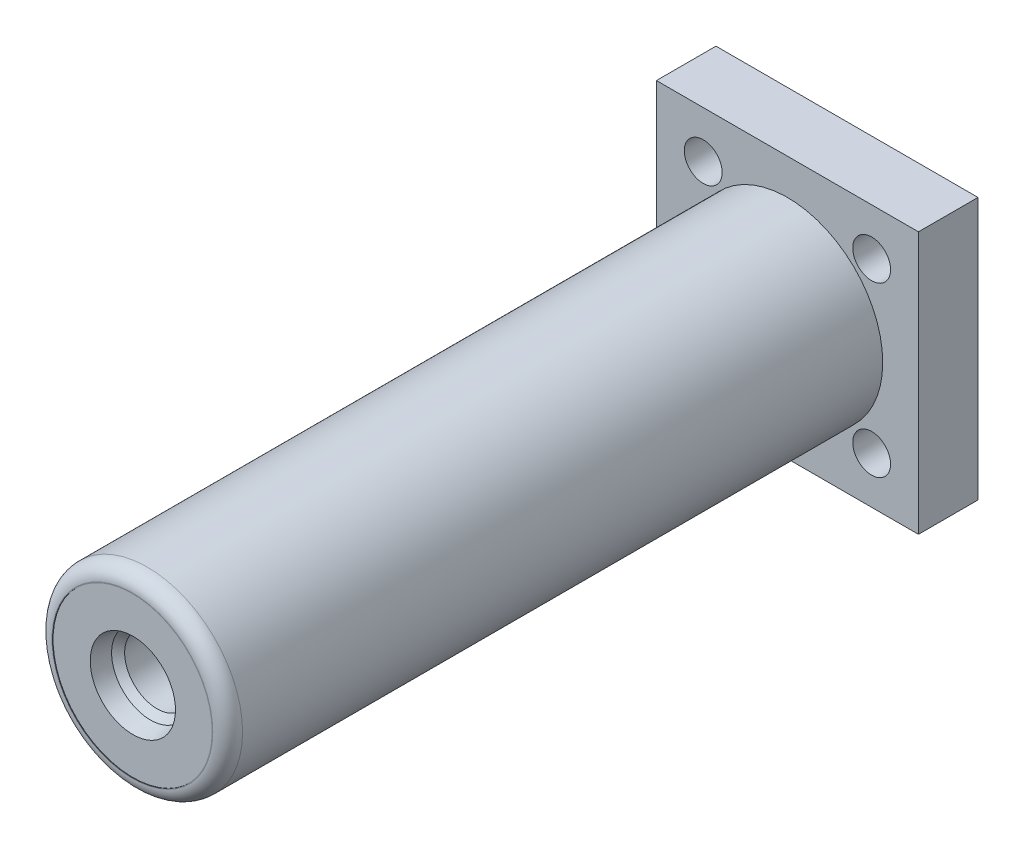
ISO-10303-21;
HEADER;
FILE_DESCRIPTION(('STEP AP214'),'2;1');
FILE_NAME('part.step','',(''),(''),'','','');
FILE_SCHEMA(('AUTOMOTIVE_DESIGN { 1 0 10303 214 1 1 1 1 }'));
ENDSEC;
DATA;
#1=APPLICATION_CONTEXT('core data for automotive mechanical design processes');
#2=APPLICATION_PROTOCOL_DEFINITION('international standard','automotive_design',2000,#1);
#3=PRODUCT_CONTEXT('',#1,'mechanical');
#4=PRODUCT('Part','Part','',(#3));
#5=PRODUCT_RELATED_PRODUCT_CATEGORY('part','',(#4));
#6=PRODUCT_DEFINITION_FORMATION('','',#4);
#7=PRODUCT_DEFINITION_CONTEXT('part definition',#1,'design');
#8=PRODUCT_DEFINITION('design','',#6,#7);
#9=PRODUCT_DEFINITION_SHAPE('','',#8);
#10=(LENGTH_UNIT() NAMED_UNIT(*) SI_UNIT(.MILLI.,.METRE.));
#11=(NAMED_UNIT(*) PLANE_ANGLE_UNIT() SI_UNIT($,.RADIAN.));
#12=(NAMED_UNIT(*) SI_UNIT($,.STERADIAN.) SOLID_ANGLE_UNIT());
#13=UNCERTAINTY_MEASURE_WITH_UNIT(LENGTH_MEASURE(1.E-05),#10,'distance_accuracy_value','');
#14=(GEOMETRIC_REPRESENTATION_CONTEXT(3) GLOBAL_UNCERTAINTY_ASSIGNED_CONTEXT((#13)) GLOBAL_UNIT_ASSIGNED_CONTEXT((#10,
#11,#12)) REPRESENTATION_CONTEXT('',''));
#15=CARTESIAN_POINT('',(0.,0.,0.));
#16=DIRECTION('',(0.,0.,1.));
#17=DIRECTION('',(1.,0.,0.));
#18=AXIS2_PLACEMENT_3D('',#15,#16,#17);
#19=CARTESIAN_POINT('',(0.,0.,50.7999999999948));
#20=DIRECTION('',(0.,0.,1.));
#21=DIRECTION('',(1.,0.,0.));
#22=AXIS2_PLACEMENT_3D('',#19,#20,#21);
#23=CYLINDRICAL_SURFACE('',#22,3.4544);
#24=CARTESIAN_POINT('',(0.,0.,73.5711));
#25=DIRECTION('',(0.,0.,1.));
#26=DIRECTION('',(1.,0.,0.));
#27=AXIS2_PLACEMENT_3D('',#24,#25,#26);
#28=CIRCLE('',#27,3.4544);
#29=CARTESIAN_POINT('',(3.4544,0.,73.5711));
#30=VERTEX_POINT('',#29);
#31=EDGE_CURVE('E160',#30,#30,#28,.T.);
#32=ORIENTED_EDGE('',*,*,#31,.T.);
#33=EDGE_LOOP('',(#32));
#34=FACE_BOUND('',#33,.T.);
#35=CARTESIAN_POINT('',(0.,0.,60.96));
#36=DIRECTION('',(0.,0.,-1.));
#37=DIRECTION('',(-1.,0.,0.));
#38=AXIS2_PLACEMENT_3D('',#35,#36,#37);
#39=CIRCLE('',#38,3.4544);
#40=CARTESIAN_POINT('',(-3.4544,0.,60.96));
#41=VERTEX_POINT('',#40);
#42=EDGE_CURVE('E157',#41,#41,#39,.T.);
#43=ORIENTED_EDGE('',*,*,#42,.T.);
#44=EDGE_LOOP('',(#43));
#45=FACE_BOUND('',#44,.T.);
#46=CARTESIAN_POINT('',(-3.4544,0.,69.69125));
#47=CARTESIAN_POINT('',(-3.4543990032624,-0.11878901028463,69.6912487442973));
#48=CARTESIAN_POINT('',(-3.4482195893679,-0.237583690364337,69.6823105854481));
#49=CARTESIAN_POINT('',(-3.42411041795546,-0.471357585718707,69.6471276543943));
#50=CARTESIAN_POINT('',(-3.40617494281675,-0.586334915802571,69.6208744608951));
#51=CARTESIAN_POINT('',(-3.36030887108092,-0.808732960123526,69.5527166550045));
#52=CARTESIAN_POINT('',(-3.33242679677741,-0.916187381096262,69.5108879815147));
#53=CARTESIAN_POINT('',(-3.26886612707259,-1.12205921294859,69.4134072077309));
#54=CARTESIAN_POINT('',(-3.23318648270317,-1.22047540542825,69.3577532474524));
#55=CARTESIAN_POINT('',(-3.15311607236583,-1.41519041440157,69.2289542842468));
#56=CARTESIAN_POINT('',(-3.10823678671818,-1.51055460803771,69.1547065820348));
#57=CARTESIAN_POINT('',(-3.01537225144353,-1.68834049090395,68.9935332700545));
#58=CARTESIAN_POINT('',(-2.96738246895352,-1.77074266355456,68.906588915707));
#59=CARTESIAN_POINT('',(-2.86373167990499,-1.93463831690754,68.7053970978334));
#60=CARTESIAN_POINT('',(-2.80815510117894,-2.01359044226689,68.589021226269));
#61=CARTESIAN_POINT('',(-2.70448941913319,-2.15081441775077,68.341636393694));
#62=CARTESIAN_POINT('',(-2.6563876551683,-2.20912145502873,68.2106528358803));
#63=CARTESIAN_POINT('',(-2.58845427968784,-2.28793091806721,67.9777486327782));
#64=CARTESIAN_POINT('',(-2.56447430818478,-2.31453836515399,67.8791178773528));
#65=CARTESIAN_POINT('',(-2.52739170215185,-2.35498172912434,67.6773587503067));
#66=CARTESIAN_POINT('',(-2.51426867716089,-2.36884159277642,67.5742391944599));
#67=CARTESIAN_POINT('',(-2.50095285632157,-2.3829023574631,67.3656605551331));
#68=CARTESIAN_POINT('',(-2.50082696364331,-2.38303258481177,67.2601921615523));
#69=CARTESIAN_POINT('',(-2.51370298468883,-2.36944117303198,67.0509398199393));
#70=CARTESIAN_POINT('',(-2.52671424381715,-2.35570967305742,66.9471571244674));
#71=CARTESIAN_POINT('',(-2.56261849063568,-2.31657191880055,66.7502244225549));
#72=CARTESIAN_POINT('',(-2.58488788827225,-2.29189677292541,66.6568077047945));
#73=CARTESIAN_POINT('',(-2.63656720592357,-2.23225222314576,66.475414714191));
#74=CARTESIAN_POINT('',(-2.66598273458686,-2.19727472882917,66.387442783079));
#75=CARTESIAN_POINT('',(-2.74552930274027,-2.09780365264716,66.1744056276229));
#76=CARTESIAN_POINT('',(-2.79859163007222,-2.02734305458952,66.0532056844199));
#77=CARTESIAN_POINT('',(-2.90788667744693,-1.8672201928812,65.8256661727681));
#78=CARTESIAN_POINT('',(-2.9641253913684,-1.77752066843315,65.7193561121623));
#79=CARTESIAN_POINT('',(-3.07443020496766,-1.57916895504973,65.5221763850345));
#80=CARTESIAN_POINT('',(-3.12846877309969,-1.47033526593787,65.4314727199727));
#81=CARTESIAN_POINT('',(-3.22828277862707,-1.23581096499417,65.2695759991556));
#82=CARTESIAN_POINT('',(-3.27407527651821,-1.11015611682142,65.1983424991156));
#83=CARTESIAN_POINT('',(-3.34372957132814,-0.874058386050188,65.0920687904));
#84=CARTESIAN_POINT('',(-3.37020272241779,-0.766420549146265,65.0525055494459));
#85=CARTESIAN_POINT('',(-3.41304858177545,-0.544693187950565,64.9890245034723));
#86=CARTESIAN_POINT('',(-3.42942814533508,-0.43060810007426,64.9650960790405));
#87=CARTESIAN_POINT('',(-3.4506556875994,-0.198648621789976,64.9341579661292));
#88=CARTESIAN_POINT('',(-3.45546120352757,-0.0807618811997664,64.9272105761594));
#89=CARTESIAN_POINT('',(-3.45294408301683,0.154611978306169,64.9308620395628));
#90=CARTESIAN_POINT('',(-3.44562134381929,0.272099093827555,64.9414610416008));
#91=CARTESIAN_POINT('',(-3.42033463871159,0.496151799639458,64.9784068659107));
#92=CARTESIAN_POINT('',(-3.40302011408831,0.602953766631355,65.0037934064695));
#93=CARTESIAN_POINT('',(-3.35966126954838,0.810431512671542,65.0682676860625));
#94=CARTESIAN_POINT('',(-3.33361533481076,0.911106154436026,65.1073579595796));
#95=CARTESIAN_POINT('',(-3.27234689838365,1.11197083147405,65.2011883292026));
#96=CARTESIAN_POINT('',(-3.23657607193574,1.21153845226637,65.2568945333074));
#97=CARTESIAN_POINT('',(-3.15950328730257,1.40029735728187,65.3806790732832));
#98=CARTESIAN_POINT('',(-3.11819745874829,1.48948129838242,65.4487660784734));
#99=CARTESIAN_POINT('',(-3.02541277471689,1.67087000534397,65.6083776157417));
#100=CARTESIAN_POINT('',(-2.97339606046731,1.7610263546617,65.7019186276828));
#101=CARTESIAN_POINT('',(-2.86983245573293,1.9251909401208,65.9025866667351));
#102=CARTESIAN_POINT('',(-2.81828586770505,1.99918939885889,66.0097218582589));
#103=CARTESIAN_POINT('',(-2.72692094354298,2.12176854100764,66.222944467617));
#104=CARTESIAN_POINT('',(-2.6864379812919,2.17233929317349,66.3275969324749));
#105=CARTESIAN_POINT('',(-2.61456388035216,2.25833747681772,66.5458321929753));
#106=CARTESIAN_POINT('',(-2.58315489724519,2.29379469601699,66.6593968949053));
#107=CARTESIAN_POINT('',(-2.53878654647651,2.3427202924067,66.8722037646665));
#108=CARTESIAN_POINT('',(-2.52351240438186,2.35901270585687,66.9703011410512));
#109=CARTESIAN_POINT('',(-2.50454292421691,2.37914907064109,67.1688358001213));
#110=CARTESIAN_POINT('',(-2.50083513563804,2.38300640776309,67.2692704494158));
#111=CARTESIAN_POINT('',(-2.50558341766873,2.37801141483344,67.4695384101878));
#112=CARTESIAN_POINT('',(-2.51404211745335,2.36915633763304,67.5693715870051));
#113=CARTESIAN_POINT('',(-2.54179191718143,2.33935293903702,67.7657135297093));
#114=CARTESIAN_POINT('',(-2.56109859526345,2.31838722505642,67.8622173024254));
#115=CARTESIAN_POINT('',(-2.61517031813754,2.25740389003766,68.078549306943));
#116=CARTESIAN_POINT('',(-2.65285060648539,2.21353180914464,68.1965482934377));
#117=CARTESIAN_POINT('',(-2.73638887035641,2.10938564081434,68.4218988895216));
#118=CARTESIAN_POINT('',(-2.78225930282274,2.04908649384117,68.5292338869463));
#119=CARTESIAN_POINT('',(-2.87817707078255,1.91209775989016,68.7347086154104));
#120=CARTESIAN_POINT('',(-2.92829406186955,1.83507699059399,68.8325943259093));
#121=CARTESIAN_POINT('',(-3.02744479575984,1.66645012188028,69.0155187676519));
#122=CARTESIAN_POINT('',(-3.07647818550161,1.57483934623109,69.1005533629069));
#123=CARTESIAN_POINT('',(-3.17677142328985,1.36261588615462,69.2681945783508));
#124=CARTESIAN_POINT('',(-3.22723128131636,1.23971100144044,69.3484551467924));
#125=CARTESIAN_POINT('',(-3.2937505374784,1.04349526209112,69.4517145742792));
#126=CARTESIAN_POINT('',(-3.31439363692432,0.976120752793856,69.483276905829));
#127=CARTESIAN_POINT('',(-3.3520169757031,0.837849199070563,69.5402352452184));
#128=CARTESIAN_POINT('',(-3.36899861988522,0.766953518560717,69.5656336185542));
#129=CARTESIAN_POINT('',(-3.40662633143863,0.583581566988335,69.6215390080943));
#130=CARTESIAN_POINT('',(-3.42440239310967,0.469080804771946,69.6475552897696));
#131=CARTESIAN_POINT('',(-3.44828509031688,0.236386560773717,69.6824045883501));
#132=CARTESIAN_POINT('',(-3.45440099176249,0.118196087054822,69.691251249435));
#133=CARTESIAN_POINT('',(-3.4544,0.,69.69125));
#134=B_SPLINE_CURVE_WITH_KNOTS('',3,(#46,#47,#48,#49,#50,#51,#52,#53,#54,#55,#56,#57,#58,#59,
#60,#61,#62,#63,#64,#65,#66,#67,#68,#69,#70,#71,#72,#73,#74,#75,#76,#77,#78,#79,#80,#81,#82,#83,
#84,#85,#86,#87,#88,#89,#90,#91,#92,#93,#94,#95,#96,#97,#98,#99,#100,#101,#102,#103,#104,#105,
#106,#107,#108,#109,#110,#111,#112,#113,#114,#115,#116,#117,#118,#119,#120,#121,#122,#123,#124,
#125,#126,#127,#128,#129,#130,#131,#132,#133),.UNSPECIFIED.,.T.,.F.,(4,2,2,2,2,2,2,2,2,2,2,2,2,
2,2,2,2,2,2,2,2,2,2,2,2,2,2,2,2,2,2,2,2,2,2,2,2,2,2,2,2,2,2,4),(0.,0.35590074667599,
0.711974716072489,1.06633489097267,1.42074276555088,1.80608526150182,2.19200251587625,
2.64359844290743,3.09442092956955,3.40801493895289,3.72101864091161,4.03563345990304,
4.35047224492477,4.64686587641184,4.94349288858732,5.39084207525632,5.83906561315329,
6.29179603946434,6.74357876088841,7.09518462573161,7.4465514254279,7.79920536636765,
8.15186229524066,8.48383146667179,8.81586206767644,9.17321282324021,9.53081477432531,
9.94900619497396,10.3674499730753,10.7353771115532,11.1025757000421,11.4030833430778,
11.7032673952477,12.0035163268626,12.304197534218,12.6962976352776,13.088999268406,
13.4903339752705,13.8917975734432,14.3544588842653,14.5857444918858,14.816941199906,
15.1713472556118,15.5254715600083),.UNSPECIFIED.);
#135=CARTESIAN_POINT('',(-3.4544,0.,69.69125));
#136=VERTEX_POINT('',#135);
#137=EDGE_CURVE('E151',#136,#136,#134,.T.);
#138=ORIENTED_EDGE('',*,*,#137,.F.);
#139=EDGE_LOOP('',(#138));
#140=FACE_BOUND('',#139,.T.);
#141=ADVANCED_FACE('F30',(#34,#45,#140),#23,.F.);
#142=CARTESIAN_POINT('',(13.97,-13.97,6.35));
#143=DIRECTION('',(0.,0.,1.));
#144=DIRECTION('',(1.,0.,0.));
#145=AXIS2_PLACEMENT_3D('',#142,#143,#144);
#146=PLANE('',#145);
#147=CARTESIAN_POINT('',(-8.98025612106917,8.98025612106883,6.35));
#148=DIRECTION('',(0.,0.,1.));
#149=DIRECTION('',(1.,0.,0.));
#150=AXIS2_PLACEMENT_3D('',#147,#148,#149);
#151=CIRCLE('',#150,2.01930000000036);
#152=CARTESIAN_POINT('',(-6.96095612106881,8.98025612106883,6.35));
#153=VERTEX_POINT('',#152);
#154=EDGE_CURVE('E128',#153,#153,#151,.T.);
#155=ORIENTED_EDGE('',*,*,#154,.F.);
#156=EDGE_LOOP('',(#155));
#157=FACE_BOUND('',#156,.T.);
#158=CARTESIAN_POINT('',(-8.98025612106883,-8.98025612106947,6.35));
#159=DIRECTION('',(0.,0.,1.));
#160=DIRECTION('',(1.,0.,0.));
#161=AXIS2_PLACEMENT_3D('',#158,#159,#160);
#162=CIRCLE('',#161,2.01930000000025);
#163=CARTESIAN_POINT('',(-6.96095612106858,-8.98025612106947,6.35));
#164=VERTEX_POINT('',#163);
#165=EDGE_CURVE('E237',#164,#164,#162,.T.);
#166=ORIENTED_EDGE('',*,*,#165,.F.);
#167=EDGE_LOOP('',(#166));
#168=FACE_BOUND('',#167,.T.);
#169=CARTESIAN_POINT('',(8.98025612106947,-8.98025612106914,6.35));
#170=DIRECTION('',(0.,0.,1.));
#171=DIRECTION('',(1.,0.,0.));
#172=AXIS2_PLACEMENT_3D('',#169,#170,#171);
#173=CIRCLE('',#172,2.01929999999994);
#174=CARTESIAN_POINT('',(10.9995561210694,-8.98025612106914,6.35));
#175=VERTEX_POINT('',#174);
#176=EDGE_CURVE('E243',#175,#175,#173,.T.);
#177=ORIENTED_EDGE('',*,*,#176,.F.);
#178=EDGE_LOOP('',(#177));
#179=FACE_BOUND('',#178,.T.);
#180=CARTESIAN_POINT('',(8.98025612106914,8.98025612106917,6.35));
#181=DIRECTION('',(0.,0.,1.));
#182=DIRECTION('',(1.,0.,0.));
#183=AXIS2_PLACEMENT_3D('',#180,#181,#182);
#184=CIRCLE('',#183,2.0193);
#185=CARTESIAN_POINT('',(10.9995561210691,8.98025612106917,6.35));
#186=VERTEX_POINT('',#185);
#187=EDGE_CURVE('E249',#186,#186,#184,.T.);
#188=ORIENTED_EDGE('',*,*,#187,.F.);
#189=EDGE_LOOP('',(#188));
#190=FACE_BOUND('',#189,.T.);
#191=DIRECTION('',(0.,1.,0.));
#192=VECTOR('',#191,1.);
#193=CARTESIAN_POINT('',(13.97,13.97,6.35));
#194=LINE('',#193,#192);
#195=CARTESIAN_POINT('',(13.97,-13.97,6.35));
#196=VERTEX_POINT('',#195);
#197=CARTESIAN_POINT('',(13.97,13.97,6.35));
#198=VERTEX_POINT('',#197);
#199=EDGE_CURVE('E103',#196,#198,#194,.T.);
#200=ORIENTED_EDGE('',*,*,#199,.T.);
#201=DIRECTION('',(-1.,0.,0.));
#202=VECTOR('',#201,1.);
#203=CARTESIAN_POINT('',(-13.97,13.97,6.35));
#204=LINE('',#203,#202);
#205=CARTESIAN_POINT('',(-13.97,13.97,6.35));
#206=VERTEX_POINT('',#205);
#207=EDGE_CURVE('E85',#198,#206,#204,.T.);
#208=ORIENTED_EDGE('',*,*,#207,.T.);
#209=DIRECTION('',(0.,-1.,0.));
#210=VECTOR('',#209,1.);
#211=CARTESIAN_POINT('',(-13.97,13.97,6.35));
#212=LINE('',#211,#210);
#213=CARTESIAN_POINT('',(-13.97,-13.97,6.35));
#214=VERTEX_POINT('',#213);
#215=EDGE_CURVE('E50',#206,#214,#212,.T.);
#216=ORIENTED_EDGE('',*,*,#215,.T.);
#217=DIRECTION('',(1.,0.,0.));
#218=VECTOR('',#217,1.);
#219=CARTESIAN_POINT('',(-13.97,-13.97,6.35));
#220=LINE('',#219,#218);
#221=EDGE_CURVE('E45',#214,#196,#220,.T.);
#222=ORIENTED_EDGE('',*,*,#221,.T.);
#223=EDGE_LOOP('',(#200,#208,#216,#222));
#224=FACE_BOUND('',#223,.T.);
#225=CARTESIAN_POINT('',(0.,0.,6.35));
#226=DIRECTION('',(0.,0.,1.));
#227=DIRECTION('',(1.,0.,0.));
#228=AXIS2_PLACEMENT_3D('',#225,#226,#227);
#229=CIRCLE('',#228,10.16);
#230=CARTESIAN_POINT('',(10.16,0.,6.35));
#231=VERTEX_POINT('',#230);
#232=EDGE_CURVE('E93',#231,#231,#229,.T.);
#233=ORIENTED_EDGE('',*,*,#232,.F.);
#234=EDGE_LOOP('',(#233));
#235=FACE_BOUND('',#234,.T.);
#236=ADVANCED_FACE('F164',(#157,#168,#179,#190,#224,#235),#146,.T.);
#237=CARTESIAN_POINT('',(13.97,13.97,6.35));
#238=DIRECTION('',(-1.,0.,0.));
#239=DIRECTION('',(0.,0.,1.));
#240=AXIS2_PLACEMENT_3D('',#237,#238,#239);
#241=PLANE('',#240);
#242=DIRECTION('',(0.,1.,0.));
#243=VECTOR('',#242,1.);
#244=CARTESIAN_POINT('',(13.97,13.97,0.));
#245=LINE('',#244,#243);
#246=CARTESIAN_POINT('',(13.97,-13.97,0.));
#247=VERTEX_POINT('',#246);
#248=CARTESIAN_POINT('',(13.97,13.97,0.));
#249=VERTEX_POINT('',#248);
#250=EDGE_CURVE('E76',#247,#249,#245,.T.);
#251=ORIENTED_EDGE('',*,*,#250,.T.);
#252=DIRECTION('',(0.,0.,-1.));
#253=VECTOR('',#252,1.);
#254=CARTESIAN_POINT('',(13.97,13.97,6.35));
#255=LINE('',#254,#253);
#256=EDGE_CURVE('E83',#198,#249,#255,.T.);
#257=ORIENTED_EDGE('',*,*,#256,.F.);
#258=ORIENTED_EDGE('',*,*,#199,.F.);
#259=DIRECTION('',(0.,0.,-1.));
#260=VECTOR('',#259,1.);
#261=CARTESIAN_POINT('',(13.97,-13.97,6.35));
#262=LINE('',#261,#260);
#263=EDGE_CURVE('E92',#196,#247,#262,.T.);
#264=ORIENTED_EDGE('',*,*,#263,.T.);
#265=EDGE_LOOP('',(#251,#257,#258,#264));
#266=FACE_BOUND('',#265,.T.);
#267=ADVANCED_FACE('F32',(#266),#241,.F.);
#268=CARTESIAN_POINT('',(-13.97,13.97,6.35));
#269=DIRECTION('',(0.,-1.,0.));
#270=DIRECTION('',(0.,0.,-1.));
#271=AXIS2_PLACEMENT_3D('',#268,#269,#270);
#272=PLANE('',#271);
#273=DIRECTION('',(-1.,0.,0.));
#274=VECTOR('',#273,1.);
#275=CARTESIAN_POINT('',(-13.97,13.97,0.));
#276=LINE('',#275,#274);
#277=CARTESIAN_POINT('',(-13.97,13.97,0.));
#278=VERTEX_POINT('',#277);
#279=EDGE_CURVE('E71',#249,#278,#276,.T.);
#280=ORIENTED_EDGE('',*,*,#279,.T.);
#281=DIRECTION('',(0.,0.,-1.));
#282=VECTOR('',#281,1.);
#283=CARTESIAN_POINT('',(-13.97,13.97,6.35));
#284=LINE('',#283,#282);
#285=EDGE_CURVE('E89',#206,#278,#284,.T.);
#286=ORIENTED_EDGE('',*,*,#285,.F.);
#287=ORIENTED_EDGE('',*,*,#207,.F.);
#288=ORIENTED_EDGE('',*,*,#256,.T.);
#289=EDGE_LOOP('',(#280,#286,#287,#288));
#290=FACE_BOUND('',#289,.T.);
#291=ADVANCED_FACE('F84',(#290),#272,.F.);
#292=CARTESIAN_POINT('',(-13.97,13.97,6.35));
#293=DIRECTION('',(1.,0.,0.));
#294=DIRECTION('',(0.,0.,-1.));
#295=AXIS2_PLACEMENT_3D('',#292,#293,#294);
#296=PLANE('',#295);
#297=DIRECTION('',(0.,-1.,0.));
#298=VECTOR('',#297,1.);
#299=CARTESIAN_POINT('',(-13.97,13.97,0.));
#300=LINE('',#299,#298);
#301=CARTESIAN_POINT('',(-13.97,-13.97,0.));
#302=VERTEX_POINT('',#301);
#303=EDGE_CURVE('E77',#278,#302,#300,.T.);
#304=ORIENTED_EDGE('',*,*,#303,.T.);
#305=DIRECTION('',(0.,0.,-1.));
#306=VECTOR('',#305,1.);
#307=CARTESIAN_POINT('',(-13.97,-13.97,6.35));
#308=LINE('',#307,#306);
#309=EDGE_CURVE('E109',#214,#302,#308,.T.);
#310=ORIENTED_EDGE('',*,*,#309,.F.);
#311=ORIENTED_EDGE('',*,*,#215,.F.);
#312=ORIENTED_EDGE('',*,*,#285,.T.);
#313=EDGE_LOOP('',(#304,#310,#311,#312));
#314=FACE_BOUND('',#313,.T.);
#315=ADVANCED_FACE('F317',(#314),#296,.F.);
#316=CARTESIAN_POINT('',(-13.97,-13.97,6.35));
#317=DIRECTION('',(0.,1.,0.));
#318=DIRECTION('',(0.,0.,1.));
#319=AXIS2_PLACEMENT_3D('',#316,#317,#318);
#320=PLANE('',#319);
#321=DIRECTION('',(1.,0.,0.));
#322=VECTOR('',#321,1.);
#323=CARTESIAN_POINT('',(-13.97,-13.97,0.));
#324=LINE('',#323,#322);
#325=EDGE_CURVE('E101',#302,#247,#324,.T.);
#326=ORIENTED_EDGE('',*,*,#325,.T.);
#327=ORIENTED_EDGE('',*,*,#263,.F.);
#328=ORIENTED_EDGE('',*,*,#221,.F.);
#329=ORIENTED_EDGE('',*,*,#309,.T.);
#330=EDGE_LOOP('',(#326,#327,#328,#329));
#331=FACE_BOUND('',#330,.T.);
#332=ADVANCED_FACE('F314',(#331),#320,.F.);
#333=CARTESIAN_POINT('',(13.97,-13.97,0.));
#334=DIRECTION('',(0.,0.,1.));
#335=DIRECTION('',(1.,0.,0.));
#336=AXIS2_PLACEMENT_3D('',#333,#334,#335);
#337=PLANE('',#336);
#338=CARTESIAN_POINT('',(0.,0.,0.));
#339=DIRECTION('',(0.,0.,1.));
#340=DIRECTION('',(1.,0.,0.));
#341=AXIS2_PLACEMENT_3D('',#338,#339,#340);
#342=CIRCLE('',#341,7.40963637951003);
#343=CARTESIAN_POINT('',(7.40963637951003,0.,0.));
#344=VERTEX_POINT('',#343);
#345=EDGE_CURVE('E11',#344,#344,#342,.T.);
#346=ORIENTED_EDGE('',*,*,#345,.T.);
#347=EDGE_LOOP('',(#346));
#348=FACE_BOUND('',#347,.T.);
#349=CARTESIAN_POINT('',(-8.98025612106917,8.98025612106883,0.));
#350=DIRECTION('',(0.,0.,1.));
#351=DIRECTION('',(1.,0.,0.));
#352=AXIS2_PLACEMENT_3D('',#349,#350,#351);
#353=CIRCLE('',#352,2.01930000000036);
#354=CARTESIAN_POINT('',(-6.96095612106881,8.98025612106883,0.));
#355=VERTEX_POINT('',#354);
#356=EDGE_CURVE('E234',#355,#355,#353,.T.);
#357=ORIENTED_EDGE('',*,*,#356,.T.);
#358=EDGE_LOOP('',(#357));
#359=FACE_BOUND('',#358,.T.);
#360=CARTESIAN_POINT('',(-8.98025612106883,-8.98025612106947,0.));
#361=DIRECTION('',(0.,0.,1.));
#362=DIRECTION('',(1.,0.,0.));
#363=AXIS2_PLACEMENT_3D('',#360,#361,#362);
#364=CIRCLE('',#363,2.01930000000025);
#365=CARTESIAN_POINT('',(-6.96095612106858,-8.98025612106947,0.));
#366=VERTEX_POINT('',#365);
#367=EDGE_CURVE('E240',#366,#366,#364,.T.);
#368=ORIENTED_EDGE('',*,*,#367,.T.);
#369=EDGE_LOOP('',(#368));
#370=FACE_BOUND('',#369,.T.);
#371=CARTESIAN_POINT('',(8.98025612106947,-8.98025612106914,0.));
#372=DIRECTION('',(0.,0.,1.));
#373=DIRECTION('',(1.,0.,0.));
#374=AXIS2_PLACEMENT_3D('',#371,#372,#373);
#375=CIRCLE('',#374,2.01929999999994);
#376=CARTESIAN_POINT('',(10.9995561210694,-8.98025612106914,0.));
#377=VERTEX_POINT('',#376);
#378=EDGE_CURVE('E246',#377,#377,#375,.T.);
#379=ORIENTED_EDGE('',*,*,#378,.T.);
#380=EDGE_LOOP('',(#379));
#381=FACE_BOUND('',#380,.T.);
#382=CARTESIAN_POINT('',(8.98025612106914,8.98025612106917,0.));
#383=DIRECTION('',(0.,0.,1.));
#384=DIRECTION('',(1.,0.,0.));
#385=AXIS2_PLACEMENT_3D('',#382,#383,#384);
#386=CIRCLE('',#385,2.0193);
#387=CARTESIAN_POINT('',(10.9995561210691,8.98025612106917,0.));
#388=VERTEX_POINT('',#387);
#389=EDGE_CURVE('E252',#388,#388,#386,.T.);
#390=ORIENTED_EDGE('',*,*,#389,.T.);
#391=EDGE_LOOP('',(#390));
#392=FACE_BOUND('',#391,.T.);
#393=ORIENTED_EDGE('',*,*,#250,.F.);
#394=ORIENTED_EDGE('',*,*,#325,.F.);
#395=ORIENTED_EDGE('',*,*,#303,.F.);
#396=ORIENTED_EDGE('',*,*,#279,.F.);
#397=EDGE_LOOP('',(#393,#394,#395,#396));
#398=FACE_BOUND('',#397,.T.);
#399=ADVANCED_FACE('F73',(#348,#359,#370,#381,#392,#398),#337,.F.);
#400=CARTESIAN_POINT('',(0.,0.,76.2));
#401=DIRECTION('',(0.,0.,-1.));
#402=DIRECTION('',(-1.,0.,0.));
#403=AXIS2_PLACEMENT_3D('',#400,#401,#402);
#404=CYLINDRICAL_SURFACE('',#403,10.16);
#405=CARTESIAN_POINT('',(0.,0.,74.6125));
#406=DIRECTION('',(0.,0.,1.));
#407=DIRECTION('',(1.,0.,0.));
#408=AXIS2_PLACEMENT_3D('',#405,#406,#407);
#409=CIRCLE('',#408,10.16);
#410=CARTESIAN_POINT('',(10.16,0.,74.6125));
#411=VERTEX_POINT('',#410);
#412=EDGE_CURVE('E159',#411,#411,#409,.F.);
#413=ORIENTED_EDGE('',*,*,#412,.T.);
#414=EDGE_LOOP('',(#413));
#415=FACE_BOUND('',#414,.T.);
#416=CARTESIAN_POINT('',(-10.16,0.,70.485));
#417=CARTESIAN_POINT('',(-10.1599991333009,-0.173835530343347,70.4849988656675));
#418=CARTESIAN_POINT('',(-10.155496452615,-0.347682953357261,70.4706763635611));
#419=CARTESIAN_POINT('',(-10.1379755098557,-0.690293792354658,70.4139149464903));
#420=CARTESIAN_POINT('',(-10.1249553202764,-0.859056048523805,70.3714696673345));
#421=CARTESIAN_POINT('',(-10.0918217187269,-1.18650650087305,70.2600337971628));
#422=CARTESIAN_POINT('',(-10.0717192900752,-1.34520984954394,70.1910842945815));
#423=CARTESIAN_POINT('',(-10.0264968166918,-1.64880239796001,70.028772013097));
#424=CARTESIAN_POINT('',(-10.0013759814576,-1.79368941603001,69.9354053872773));
#425=CARTESIAN_POINT('',(-9.94791542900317,-2.07001195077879,69.7238737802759));
#426=CARTESIAN_POINT('',(-9.91950558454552,-2.20096087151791,69.6050909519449));
#427=CARTESIAN_POINT('',(-9.8630751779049,-2.44144135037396,69.3474142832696));
#428=CARTESIAN_POINT('',(-9.83505468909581,-2.55096892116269,69.2085167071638));
#429=CARTESIAN_POINT('',(-9.78182307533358,-2.74813614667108,68.9103408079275));
#430=CARTESIAN_POINT('',(-9.75669850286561,-2.83516791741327,68.7506436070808));
#431=CARTESIAN_POINT('',(-9.71315816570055,-2.98093742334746,68.417967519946));
#432=CARTESIAN_POINT('',(-9.69474063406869,-3.03968261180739,68.2449921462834));
#433=CARTESIAN_POINT('',(-9.66743321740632,-3.12543088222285,67.8961606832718));
#434=CARTESIAN_POINT('',(-9.65827311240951,-3.15333659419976,67.7205482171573));
#435=CARTESIAN_POINT('',(-9.64971540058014,-3.1794336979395,67.3669134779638));
#436=CARTESIAN_POINT('',(-9.65031519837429,-3.1776329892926,67.188891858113));
#437=CARTESIAN_POINT('',(-9.66097100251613,-3.14507434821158,66.8429588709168));
#438=CARTESIAN_POINT('',(-9.6706522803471,-3.11546386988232,66.6749260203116));
#439=CARTESIAN_POINT('',(-9.69777145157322,-3.0299866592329,66.3463439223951));
#440=CARTESIAN_POINT('',(-9.71521016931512,-2.97411713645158,66.1857954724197));
#441=CARTESIAN_POINT('',(-9.75616651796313,-2.83689741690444,65.8740060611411));
#442=CARTESIAN_POINT('',(-9.77976923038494,-2.75518691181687,65.7229353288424));
#443=CARTESIAN_POINT('',(-9.83035515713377,-2.56885492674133,65.436273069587));
#444=CARTESIAN_POINT('',(-9.8573392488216,-2.46422749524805,65.3006855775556));
#445=CARTESIAN_POINT('',(-9.91315080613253,-2.22940106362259,65.0423516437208));
#446=CARTESIAN_POINT('',(-9.94200626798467,-2.09825480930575,64.9204707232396));
#447=CARTESIAN_POINT('',(-9.99722589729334,-1.81702559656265,64.7002213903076));
#448=CARTESIAN_POINT('',(-10.0235898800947,-1.66694123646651,64.6018547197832));
#449=CARTESIAN_POINT('',(-10.0711328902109,-1.35042811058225,64.4308396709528));
#450=CARTESIAN_POINT('',(-10.0922699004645,-1.18388106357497,64.3583977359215));
#451=CARTESIAN_POINT('',(-10.1266740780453,-0.840150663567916,64.242815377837));
#452=CARTESIAN_POINT('',(-10.1399436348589,-0.662970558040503,64.1996660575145));
#453=CARTESIAN_POINT('',(-10.1567332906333,-0.310350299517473,64.1453681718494));
#454=CARTESIAN_POINT('',(-10.1606101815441,-0.135107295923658,64.1330478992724));
#455=CARTESIAN_POINT('',(-10.159232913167,0.214960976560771,64.1374542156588));
#456=CARTESIAN_POINT('',(-10.1539800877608,0.389786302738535,64.1541765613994));
#457=CARTESIAN_POINT('',(-10.1351680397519,0.729537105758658,64.2152528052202));
#458=CARTESIAN_POINT('',(-10.1218185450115,0.89460064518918,64.2589094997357));
#459=CARTESIAN_POINT('',(-10.088375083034,1.2150138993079,64.3717644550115));
#460=CARTESIAN_POINT('',(-10.0682802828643,1.37036241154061,64.4409658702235));
#461=CARTESIAN_POINT('',(-10.0228029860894,1.67114831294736,64.6048319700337));
#462=CARTESIAN_POINT('',(-9.99730352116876,1.81625173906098,64.7000763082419));
#463=CARTESIAN_POINT('',(-9.94393261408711,2.08880926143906,64.9126291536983));
#464=CARTESIAN_POINT('',(-9.91606052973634,2.21625855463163,65.0299436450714));
#465=CARTESIAN_POINT('',(-9.85969567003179,2.45513215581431,65.2888175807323));
#466=CARTESIAN_POINT('',(-9.83122206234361,2.56572136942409,65.4311535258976));
#467=CARTESIAN_POINT('',(-9.77803345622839,2.76151975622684,65.732981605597));
#468=CARTESIAN_POINT('',(-9.75331839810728,2.84672933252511,65.8924734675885));
#469=CARTESIAN_POINT('',(-9.71071927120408,2.98882012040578,66.223756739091));
#470=CARTESIAN_POINT('',(-9.69280881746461,3.04581101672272,66.3954975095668));
#471=CARTESIAN_POINT('',(-9.66599973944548,3.12986151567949,66.7468121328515));
#472=CARTESIAN_POINT('',(-9.65709768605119,3.15693250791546,66.9263829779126));
#473=CARTESIAN_POINT('',(-9.64967063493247,3.17955691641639,67.2795303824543));
#474=CARTESIAN_POINT('',(-9.6506945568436,3.17648030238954,67.4530107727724));
#475=CARTESIAN_POINT('',(-9.66190829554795,3.14220398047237,67.7968534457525));
#476=CARTESIAN_POINT('',(-9.67209768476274,3.1110055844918,67.9672158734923));
#477=CARTESIAN_POINT('',(-9.7001790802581,3.02228833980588,68.2975368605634));
#478=CARTESIAN_POINT('',(-9.71795613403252,2.96516151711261,68.4576112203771));
#479=CARTESIAN_POINT('',(-9.75918048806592,2.82651777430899,68.7660306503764));
#480=CARTESIAN_POINT('',(-9.78262894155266,2.74499589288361,68.9143733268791));
#481=CARTESIAN_POINT('',(-9.83369857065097,2.55614614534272,69.2014007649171));
#482=CARTESIAN_POINT('',(-9.8614471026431,2.44793347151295,69.3394806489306));
#483=CARTESIAN_POINT('',(-9.91740457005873,2.21033085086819,69.5959652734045));
#484=CARTESIAN_POINT('',(-9.94561362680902,2.08093523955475,69.7143647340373));
#485=CARTESIAN_POINT('',(-10.0004187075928,1.7995561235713,69.9319976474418));
#486=CARTESIAN_POINT('',(-10.0269319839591,1.64697301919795,70.0304790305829));
#487=CARTESIAN_POINT('',(-10.0743199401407,1.32658901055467,70.2002632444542));
#488=CARTESIAN_POINT('',(-10.0951968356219,1.15879412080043,70.2715767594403));
#489=CARTESIAN_POINT('',(-10.1275045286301,0.827398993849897,70.3798220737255));
#490=CARTESIAN_POINT('',(-10.139584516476,0.664642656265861,70.4191501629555));
#491=CARTESIAN_POINT('',(-10.1558318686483,0.334593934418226,70.471737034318));
#492=CARTESIAN_POINT('',(-10.1600008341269,0.167302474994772,70.4850010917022));
#493=CARTESIAN_POINT('',(-10.16,0.,70.485));
#494=B_SPLINE_CURVE_WITH_KNOTS('',3,(#416,#417,#418,#419,#420,#421,#422,#423,#424,#425,#426,
#427,#428,#429,#430,#431,#432,#433,#434,#435,#436,#437,#438,#439,#440,#441,#442,#443,#444,#445,
#446,#447,#448,#449,#450,#451,#452,#453,#454,#455,#456,#457,#458,#459,#460,#461,#462,#463,#464,
#465,#466,#467,#468,#469,#470,#471,#472,#473,#474,#475,#476,#477,#478,#479,#480,#481,#482,#483,
#484,#485,#486,#487,#488,#489,#490,#491,#492,#493),.UNSPECIFIED.,.T.,.F.,(4,2,2,2,2,2,2,2,2,2,2,
2,2,2,2,2,2,2,2,2,2,2,2,2,2,2,2,2,2,2,2,2,2,2,2,2,2,2,4),(0.,0.520891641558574,1.04190120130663,
1.56210629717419,2.08239340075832,2.61716068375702,3.15202741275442,3.70011378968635,
4.24805567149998,4.77949641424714,5.31079583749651,5.8210937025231,6.33144580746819,
6.84925332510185,7.36719547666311,7.90871538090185,8.45027538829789,8.99605670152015,
9.54167216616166,10.0662122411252,10.5906756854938,11.1021019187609,11.6135913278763,
12.1375506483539,12.6616522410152,13.2065211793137,13.7513814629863,14.2941069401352,
14.8366257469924,15.3546099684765,15.8725700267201,16.3829470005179,16.8934278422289,
17.4238796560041,17.9544735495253,18.5023929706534,19.0500966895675,19.5515137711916,
20.0528293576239),.UNSPECIFIED.);
#495=CARTESIAN_POINT('',(-10.16,0.,70.485));
#496=VERTEX_POINT('',#495);
#497=EDGE_CURVE('E120',#496,#496,#494,.T.);
#498=ORIENTED_EDGE('',*,*,#497,.T.);
#499=EDGE_LOOP('',(#498));
#500=FACE_BOUND('',#499,.T.);
#501=ORIENTED_EDGE('',*,*,#232,.T.);
#502=EDGE_LOOP('',(#501));
#503=FACE_BOUND('',#502,.T.);
#504=ADVANCED_FACE('F130',(#415,#500,#503),#404,.T.);
#505=CARTESIAN_POINT('',(0.,0.,76.2));
#506=DIRECTION('',(0.,0.,1.));
#507=DIRECTION('',(1.,0.,0.));
#508=AXIS2_PLACEMENT_3D('',#505,#506,#507);
#509=PLANE('',#508);
#510=CARTESIAN_POINT('',(0.,0.,76.2));
#511=DIRECTION('',(0.,0.,1.));
#512=DIRECTION('',(1.,0.,0.));
#513=AXIS2_PLACEMENT_3D('',#510,#511,#512);
#514=CIRCLE('',#513,8.509);
#515=CARTESIAN_POINT('',(8.509,0.,76.2));
#516=VERTEX_POINT('',#515);
#517=EDGE_CURVE('E218',#516,#516,#514,.T.);
#518=ORIENTED_EDGE('',*,*,#517,.F.);
#519=EDGE_LOOP('',(#518));
#520=FACE_BOUND('',#519,.T.);
#521=CARTESIAN_POINT('',(0.,0.,76.2));
#522=DIRECTION('',(0.,0.,1.));
#523=DIRECTION('',(1.,0.,0.));
#524=AXIS2_PLACEMENT_3D('',#521,#522,#523);
#525=CIRCLE('',#524,8.5725);
#526=CARTESIAN_POINT('',(8.5725,0.,76.2));
#527=VERTEX_POINT('',#526);
#528=EDGE_CURVE('E88',#527,#527,#525,.T.);
#529=ORIENTED_EDGE('',*,*,#528,.T.);
#530=EDGE_LOOP('',(#529));
#531=FACE_BOUND('',#530,.T.);
#532=ADVANCED_FACE('F270',(#520,#531),#509,.T.);
#533=CARTESIAN_POINT('',(0.,0.,8.128));
#534=DIRECTION('',(0.,0.,-1.));
#535=DIRECTION('',(-1.,0.,0.));
#536=AXIS2_PLACEMENT_3D('',#533,#534,#535);
#537=PLANE('',#536);
#538=CARTESIAN_POINT('',(0.,0.,8.128));
#539=DIRECTION('',(0.,0.,-1.));
#540=DIRECTION('',(-1.,0.,0.));
#541=AXIS2_PLACEMENT_3D('',#538,#539,#540);
#542=CIRCLE('',#541,7.1374);
#543=CARTESIAN_POINT('',(-7.1374,0.,8.128));
#544=VERTEX_POINT('',#543);
#545=EDGE_CURVE('E116',#544,#544,#542,.T.);
#546=ORIENTED_EDGE('',*,*,#545,.T.);
#547=EDGE_LOOP('',(#546));
#548=FACE_BOUND('',#547,.T.);
#549=CARTESIAN_POINT('',(0.,0.,8.128));
#550=DIRECTION('',(0.,0.,-1.));
#551=DIRECTION('',(-1.,0.,0.));
#552=AXIS2_PLACEMENT_3D('',#549,#550,#551);
#553=CIRCLE('',#552,5.715);
#554=CARTESIAN_POINT('',(-5.715,0.,8.12800000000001));
#555=VERTEX_POINT('',#554);
#556=EDGE_CURVE('E113',#555,#555,#553,.F.);
#557=ORIENTED_EDGE('',*,*,#556,.T.);
#558=EDGE_LOOP('',(#557));
#559=FACE_BOUND('',#558,.T.);
#560=ADVANCED_FACE('F268',(#548,#559),#537,.T.);
#561=CARTESIAN_POINT('',(0.,0.,8.128));
#562=DIRECTION('',(0.,0.,-1.));
#563=DIRECTION('',(-1.,0.,0.));
#564=AXIS2_PLACEMENT_3D('',#561,#562,#563);
#565=CYLINDRICAL_SURFACE('',#564,7.1374);
#566=CARTESIAN_POINT('',(0.,0.,1.01600000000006));
#567=DIRECTION('',(0.,0.,1.));
#568=DIRECTION('',(1.,0.,0.));
#569=AXIS2_PLACEMENT_3D('',#566,#567,#568);
#570=CIRCLE('',#569,7.1374);
#571=CARTESIAN_POINT('',(7.1374,0.,1.01600000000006));
#572=VERTEX_POINT('',#571);
#573=EDGE_CURVE('E38',#572,#572,#570,.F.);
#574=ORIENTED_EDGE('',*,*,#573,.T.);
#575=EDGE_LOOP('',(#574));
#576=FACE_BOUND('',#575,.T.);
#577=ORIENTED_EDGE('',*,*,#545,.F.);
#578=EDGE_LOOP('',(#577));
#579=FACE_BOUND('',#578,.T.);
#580=ADVANCED_FACE('F185',(#576,#579),#565,.F.);
#581=CARTESIAN_POINT('',(0.,0.,60.96));
#582=DIRECTION('',(0.,0.,-1.));
#583=DIRECTION('',(-1.,0.,0.));
#584=AXIS2_PLACEMENT_3D('',#581,#582,#583);
#585=PLANE('',#584);
#586=ORIENTED_EDGE('',*,*,#42,.F.);
#587=EDGE_LOOP('',(#586));
#588=FACE_BOUND('',#587,.T.);
#589=CARTESIAN_POINT('',(0.,0.,60.96));
#590=DIRECTION('',(0.,0.,-1.));
#591=DIRECTION('',(-1.,0.,0.));
#592=AXIS2_PLACEMENT_3D('',#589,#590,#591);
#593=CIRCLE('',#592,5.715);
#594=CARTESIAN_POINT('',(-5.715,0.,60.96));
#595=VERTEX_POINT('',#594);
#596=EDGE_CURVE('E96',#595,#595,#593,.T.);
#597=ORIENTED_EDGE('',*,*,#596,.T.);
#598=EDGE_LOOP('',(#597));
#599=FACE_BOUND('',#598,.T.);
#600=ADVANCED_FACE('F259',(#588,#599),#585,.T.);
#601=CARTESIAN_POINT('',(0.,0.,60.96));
#602=DIRECTION('',(0.,0.,-1.));
#603=DIRECTION('',(-1.,0.,0.));
#604=AXIS2_PLACEMENT_3D('',#601,#602,#603);
#605=CYLINDRICAL_SURFACE('',#604,5.715);
#606=CARTESIAN_POINT('',(-5.715,0.,60.96));
#607=CARTESIAN_POINT('',(-5.715,0.,60.4096666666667));
#608=CARTESIAN_POINT('',(-5.715,0.,59.8593333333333));
#609=CARTESIAN_POINT('',(-5.715,0.,58.7586666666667));
#610=CARTESIAN_POINT('',(-5.715,0.,58.2083333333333));
#611=CARTESIAN_POINT('',(-5.715,0.,57.1076666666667));
#612=CARTESIAN_POINT('',(-5.715,0.,56.5573333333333));
#613=CARTESIAN_POINT('',(-5.715,0.,55.4566666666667));
#614=CARTESIAN_POINT('',(-5.715,0.,54.9063333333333));
#615=CARTESIAN_POINT('',(-5.715,0.,53.8056666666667));
#616=CARTESIAN_POINT('',(-5.715,0.,53.2553333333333));
#617=CARTESIAN_POINT('',(-5.715,0.,52.1546666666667));
#618=CARTESIAN_POINT('',(-5.715,0.,51.6043333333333));
#619=CARTESIAN_POINT('',(-5.715,0.,50.5036666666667));
#620=CARTESIAN_POINT('',(-5.715,0.,49.9533333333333));
#621=CARTESIAN_POINT('',(-5.715,0.,48.8526666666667));
#622=CARTESIAN_POINT('',(-5.715,0.,48.3023333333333));
#623=CARTESIAN_POINT('',(-5.715,0.,47.2016666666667));
#624=CARTESIAN_POINT('',(-5.715,0.,46.6513333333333));
#625=CARTESIAN_POINT('',(-5.715,0.,45.5506666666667));
#626=CARTESIAN_POINT('',(-5.715,0.,45.0003333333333));
#627=CARTESIAN_POINT('',(-5.715,0.,43.8996666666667));
#628=CARTESIAN_POINT('',(-5.715,0.,43.3493333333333));
#629=CARTESIAN_POINT('',(-5.715,0.,42.2486666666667));
#630=CARTESIAN_POINT('',(-5.715,0.,41.6983333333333));
#631=CARTESIAN_POINT('',(-5.715,0.,40.5976666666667));
#632=CARTESIAN_POINT('',(-5.715,0.,40.0473333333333));
#633=CARTESIAN_POINT('',(-5.715,0.,38.9466666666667));
#634=CARTESIAN_POINT('',(-5.715,0.,38.3963333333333));
#635=CARTESIAN_POINT('',(-5.715,0.,37.2956666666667));
#636=CARTESIAN_POINT('',(-5.715,0.,36.7453333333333));
#637=CARTESIAN_POINT('',(-5.715,0.,35.6446666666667));
#638=CARTESIAN_POINT('',(-5.715,0.,35.0943333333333));
#639=CARTESIAN_POINT('',(-5.715,0.,33.9936666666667));
#640=CARTESIAN_POINT('',(-5.715,0.,33.4433333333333));
#641=CARTESIAN_POINT('',(-5.715,0.,32.3426666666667));
#642=CARTESIAN_POINT('',(-5.715,0.,31.7923333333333));
#643=CARTESIAN_POINT('',(-5.715,0.,30.6916666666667));
#644=CARTESIAN_POINT('',(-5.715,0.,30.1413333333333));
#645=CARTESIAN_POINT('',(-5.715,0.,29.0406666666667));
#646=CARTESIAN_POINT('',(-5.715,0.,28.4903333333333));
#647=CARTESIAN_POINT('',(-5.715,0.,27.3896666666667));
#648=CARTESIAN_POINT('',(-5.715,0.,26.8393333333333));
#649=CARTESIAN_POINT('',(-5.715,0.,25.7386666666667));
#650=CARTESIAN_POINT('',(-5.715,0.,25.1883333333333));
#651=CARTESIAN_POINT('',(-5.715,0.,24.0876666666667));
#652=CARTESIAN_POINT('',(-5.715,0.,23.5373333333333));
#653=CARTESIAN_POINT('',(-5.715,0.,22.4366666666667));
#654=CARTESIAN_POINT('',(-5.715,0.,21.8863333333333));
#655=CARTESIAN_POINT('',(-5.715,0.,20.7856666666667));
#656=CARTESIAN_POINT('',(-5.715,0.,20.2353333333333));
#657=CARTESIAN_POINT('',(-5.715,0.,19.1346666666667));
#658=CARTESIAN_POINT('',(-5.715,0.,18.5843333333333));
#659=CARTESIAN_POINT('',(-5.715,0.,17.4836666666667));
#660=CARTESIAN_POINT('',(-5.715,0.,16.9333333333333));
#661=CARTESIAN_POINT('',(-5.715,0.,15.8326666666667));
#662=CARTESIAN_POINT('',(-5.715,0.,15.2823333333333));
#663=CARTESIAN_POINT('',(-5.715,0.,14.1816666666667));
#664=CARTESIAN_POINT('',(-5.715,0.,13.6313333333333));
#665=CARTESIAN_POINT('',(-5.715,0.,12.5306666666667));
#666=CARTESIAN_POINT('',(-5.715,0.,11.9803333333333));
#667=CARTESIAN_POINT('',(-5.715,0.,10.8796666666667));
#668=CARTESIAN_POINT('',(-5.715,0.,10.3293333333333));
#669=CARTESIAN_POINT('',(-5.715,0.,9.22866666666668));
#670=CARTESIAN_POINT('',(-5.715,0.,8.67833333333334));
#671=CARTESIAN_POINT('',(-5.715,0.,8.12800000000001));
#672=B_SPLINE_CURVE_WITH_KNOTS('',3,(#606,#607,#608,#609,#610,#611,#612,#613,#614,#615,#616,
#617,#618,#619,#620,#621,#622,#623,#624,#625,#626,#627,#628,#629,#630,#631,#632,#633,#634,#635,
#636,#637,#638,#639,#640,#641,#642,#643,#644,#645,#646,#647,#648,#649,#650,#651,#652,#653,#654,
#655,#656,#657,#658,#659,#660,#661,#662,#663,#664,#665,#666,#667,#668,#669,#670,#671),
.UNSPECIFIED.,.F.,.F.,(4,2,2,2,2,2,2,2,2,2,2,2,2,2,2,2,2,2,2,2,2,2,2,2,2,2,2,2,2,2,2,2,4),(0.,
1.65099999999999,3.30199999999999,4.95299999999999,6.60399999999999,8.25499999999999,
9.90599999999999,11.557,13.208,14.859,16.51,18.161,19.812,21.463,23.114,24.765,26.416,28.067,
29.718,31.369,33.02,34.671,36.322,37.973,39.624,41.275,42.926,44.577,46.228,47.879,49.53,51.181,
52.832),.UNSPECIFIED.);
#673=EDGE_CURVE('BSEAM261',#595,#555,#672,.T.);
#674=ORIENTED_EDGE('',*,*,#596,.F.);
#675=ORIENTED_EDGE('',*,*,#556,.F.);
#676=ORIENTED_EDGE('',*,*,#673,.T.);
#677=ORIENTED_EDGE('',*,*,#673,.F.);
#678=EDGE_LOOP('',(#674,#676,#675,#677));
#679=FACE_BOUND('',#678,.T.);
#680=ADVANCED_FACE('F261',(#679),#605,.F.);
#681=CARTESIAN_POINT('',(8.98025612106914,8.98025612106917,0.));
#682=DIRECTION('',(0.,0.,1.));
#683=DIRECTION('',(1.,0.,0.));
#684=AXIS2_PLACEMENT_3D('',#681,#682,#683);
#685=CYLINDRICAL_SURFACE('',#684,2.0193);
#686=ORIENTED_EDGE('',*,*,#389,.F.);
#687=EDGE_LOOP('',(#686));
#688=FACE_BOUND('',#687,.T.);
#689=ORIENTED_EDGE('',*,*,#187,.T.);
#690=EDGE_LOOP('',(#689));
#691=FACE_BOUND('',#690,.T.);
#692=ADVANCED_FACE('F264',(#688,#691),#685,.F.);
#693=CARTESIAN_POINT('',(8.98025612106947,-8.98025612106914,0.));
#694=DIRECTION('',(0.,0.,1.));
#695=DIRECTION('',(1.,0.,0.));
#696=AXIS2_PLACEMENT_3D('',#693,#694,#695);
#697=CYLINDRICAL_SURFACE('',#696,2.01929999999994);
#698=ORIENTED_EDGE('',*,*,#378,.F.);
#699=EDGE_LOOP('',(#698));
#700=FACE_BOUND('',#699,.T.);
#701=ORIENTED_EDGE('',*,*,#176,.T.);
#702=EDGE_LOOP('',(#701));
#703=FACE_BOUND('',#702,.T.);
#704=ADVANCED_FACE('F411',(#700,#703),#697,.F.);
#705=CARTESIAN_POINT('',(-8.98025612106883,-8.98025612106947,0.));
#706=DIRECTION('',(0.,0.,1.));
#707=DIRECTION('',(1.,0.,0.));
#708=AXIS2_PLACEMENT_3D('',#705,#706,#707);
#709=CYLINDRICAL_SURFACE('',#708,2.01930000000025);
#710=ORIENTED_EDGE('',*,*,#367,.F.);
#711=EDGE_LOOP('',(#710));
#712=FACE_BOUND('',#711,.T.);
#713=ORIENTED_EDGE('',*,*,#165,.T.);
#714=EDGE_LOOP('',(#713));
#715=FACE_BOUND('',#714,.T.);
#716=ADVANCED_FACE('F419',(#712,#715),#709,.F.);
#717=CARTESIAN_POINT('',(-8.98025612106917,8.98025612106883,0.));
#718=DIRECTION('',(0.,0.,1.));
#719=DIRECTION('',(1.,0.,0.));
#720=AXIS2_PLACEMENT_3D('',#717,#718,#719);
#721=CYLINDRICAL_SURFACE('',#720,2.01930000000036);
#722=ORIENTED_EDGE('',*,*,#356,.F.);
#723=EDGE_LOOP('',(#722));
#724=FACE_BOUND('',#723,.T.);
#725=ORIENTED_EDGE('',*,*,#154,.T.);
#726=EDGE_LOOP('',(#725));
#727=FACE_BOUND('',#726,.T.);
#728=ADVANCED_FACE('F140',(#724,#727),#721,.F.);
#729=CARTESIAN_POINT('',(-5.08,0.,67.31));
#730=DIRECTION('',(-1.,0.,0.));
#731=DIRECTION('',(0.,0.,1.));
#732=AXIS2_PLACEMENT_3D('',#729,#730,#731);
#733=CYLINDRICAL_SURFACE('',#732,3.175);
#734=CARTESIAN_POINT('',(-5.08,0.,67.31));
#735=DIRECTION('',(-1.,0.,0.));
#736=DIRECTION('',(0.,0.,1.));
#737=AXIS2_PLACEMENT_3D('',#734,#735,#736);
#738=CIRCLE('',#737,3.175);
#739=CARTESIAN_POINT('',(-5.08,0.,70.485));
#740=VERTEX_POINT('',#739);
#741=EDGE_CURVE('E121',#740,#740,#738,.T.);
#742=ORIENTED_EDGE('',*,*,#741,.F.);
#743=EDGE_LOOP('',(#742));
#744=FACE_BOUND('',#743,.T.);
#745=ORIENTED_EDGE('',*,*,#497,.F.);
#746=EDGE_LOOP('',(#745));
#747=FACE_BOUND('',#746,.T.);
#748=ADVANCED_FACE('F134',(#744,#747),#733,.F.);
#749=CARTESIAN_POINT('',(-5.08,0.,67.31));
#750=DIRECTION('',(-1.,0.,0.));
#751=DIRECTION('',(0.,0.,1.));
#752=AXIS2_PLACEMENT_3D('',#749,#750,#751);
#753=PLANE('',#752);
#754=ORIENTED_EDGE('',*,*,#741,.T.);
#755=EDGE_LOOP('',(#754));
#756=FACE_BOUND('',#755,.T.);
#757=CARTESIAN_POINT('',(-5.08,0.,67.31));
#758=DIRECTION('',(-1.,0.,0.));
#759=DIRECTION('',(0.,0.,1.));
#760=AXIS2_PLACEMENT_3D('',#757,#758,#759);
#761=CIRCLE('',#760,2.38125000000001);
#762=CARTESIAN_POINT('',(-5.08,0.,69.69125));
#763=VERTEX_POINT('',#762);
#764=EDGE_CURVE('E117',#763,#763,#761,.F.);
#765=ORIENTED_EDGE('',*,*,#764,.T.);
#766=EDGE_LOOP('',(#765));
#767=FACE_BOUND('',#766,.T.);
#768=ADVANCED_FACE('F139',(#756,#767),#753,.T.);
#769=CARTESIAN_POINT('',(2.032,0.,67.31));
#770=DIRECTION('',(-1.,0.,0.));
#771=DIRECTION('',(0.,0.,1.));
#772=AXIS2_PLACEMENT_3D('',#769,#770,#771);
#773=CYLINDRICAL_SURFACE('',#772,2.38125000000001);
#774=ORIENTED_EDGE('',*,*,#137,.T.);
#775=EDGE_LOOP('',(#774));
#776=FACE_BOUND('',#775,.T.);
#777=ORIENTED_EDGE('',*,*,#764,.F.);
#778=EDGE_LOOP('',(#777));
#779=FACE_BOUND('',#778,.T.);
#780=ADVANCED_FACE('F143',(#776,#779),#773,.F.);
#781=CARTESIAN_POINT('',(0.,0.,74.6125));
#782=DIRECTION('',(0.,0.,1.));
#783=DIRECTION('',(1.,0.,0.));
#784=AXIS2_PLACEMENT_3D('',#781,#782,#783);
#785=TOROIDAL_SURFACE('',#784,8.5725,1.5875);
#786=ORIENTED_EDGE('',*,*,#412,.F.);
#787=EDGE_LOOP('',(#786));
#788=FACE_BOUND('',#787,.T.);
#789=ORIENTED_EDGE('',*,*,#528,.F.);
#790=EDGE_LOOP('',(#789));
#791=FACE_BOUND('',#790,.T.);
#792=ADVANCED_FACE('F147',(#788,#791),#785,.T.);
#793=CARTESIAN_POINT('',(0.,0.,76.1492));
#794=DIRECTION('',(0.,0.,1.));
#795=DIRECTION('',(1.,0.,0.));
#796=AXIS2_PLACEMENT_3D('',#793,#794,#795);
#797=PLANE('',#796);
#798=CARTESIAN_POINT('',(0.,0.,76.1492));
#799=DIRECTION('',(0.,0.,1.));
#800=DIRECTION('',(1.,0.,0.));
#801=AXIS2_PLACEMENT_3D('',#798,#799,#800);
#802=CIRCLE('',#801,4.5466);
#803=CARTESIAN_POINT('',(4.5466,0.,76.1492));
#804=VERTEX_POINT('',#803);
#805=EDGE_CURVE('E217',#804,#804,#802,.T.);
#806=ORIENTED_EDGE('',*,*,#805,.F.);
#807=EDGE_LOOP('',(#806));
#808=FACE_BOUND('',#807,.T.);
#809=CARTESIAN_POINT('',(0.,0.,76.1492));
#810=DIRECTION('',(0.,0.,1.));
#811=DIRECTION('',(1.,0.,0.));
#812=AXIS2_PLACEMENT_3D('',#809,#810,#811);
#813=CIRCLE('',#812,8.509);
#814=CARTESIAN_POINT('',(8.509,0.,76.1492));
#815=VERTEX_POINT('',#814);
#816=EDGE_CURVE('E158',#815,#815,#813,.T.);
#817=ORIENTED_EDGE('',*,*,#816,.T.);
#818=EDGE_LOOP('',(#817));
#819=FACE_BOUND('',#818,.T.);
#820=ADVANCED_FACE('F169',(#808,#819),#797,.T.);
#821=CARTESIAN_POINT('',(0.,0.,76.1492));
#822=DIRECTION('',(0.,0.,1.));
#823=DIRECTION('',(1.,0.,0.));
#824=AXIS2_PLACEMENT_3D('',#821,#822,#823);
#825=CYLINDRICAL_SURFACE('',#824,8.509);
#826=ORIENTED_EDGE('',*,*,#816,.F.);
#827=EDGE_LOOP('',(#826));
#828=FACE_BOUND('',#827,.T.);
#829=ORIENTED_EDGE('',*,*,#517,.T.);
#830=EDGE_LOOP('',(#829));
#831=FACE_BOUND('',#830,.T.);
#832=ADVANCED_FACE('F166',(#828,#831),#825,.F.);
#833=CARTESIAN_POINT('',(0.,0.,76.1492));
#834=DIRECTION('',(0.,0.,1.));
#835=DIRECTION('',(1.,0.,0.));
#836=AXIS2_PLACEMENT_3D('',#833,#834,#835);
#837=CONICAL_SURFACE('',#836,4.5466,0.20943951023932);
#838=CARTESIAN_POINT('',(0.,0.,74.2696));
#839=DIRECTION('',(0.,0.,1.));
#840=DIRECTION('',(1.,0.,0.));
#841=AXIS2_PLACEMENT_3D('',#838,#839,#840);
#842=CIRCLE('',#841,4.14707868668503);
#843=CARTESIAN_POINT('',(4.14707868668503,0.,74.2696));
#844=VERTEX_POINT('',#843);
#845=EDGE_CURVE('E214',#844,#844,#842,.F.);
#846=ORIENTED_EDGE('',*,*,#845,.T.);
#847=EDGE_LOOP('',(#846));
#848=FACE_BOUND('',#847,.T.);
#849=ORIENTED_EDGE('',*,*,#805,.T.);
#850=EDGE_LOOP('',(#849));
#851=FACE_BOUND('',#850,.T.);
#852=ADVANCED_FACE('F203',(#848,#851),#837,.F.);
#853=CARTESIAN_POINT('',(0.,0.,74.2696));
#854=DIRECTION('',(0.,0.,1.));
#855=DIRECTION('',(1.,0.,0.));
#856=AXIS2_PLACEMENT_3D('',#853,#854,#855);
#857=CONICAL_SURFACE('',#856,4.1529,0.78539816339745);
#858=CARTESIAN_POINT('',(0.,0.,74.2696));
#859=DIRECTION('',(0.,0.,1.));
#860=DIRECTION('',(1.,0.,0.));
#861=AXIS2_PLACEMENT_3D('',#858,#859,#860);
#862=CIRCLE('',#861,4.1529);
#863=CARTESIAN_POINT('',(4.1529,0.,74.2696));
#864=VERTEX_POINT('',#863);
#865=EDGE_CURVE('E504',#864,#864,#862,.T.);
#866=ORIENTED_EDGE('',*,*,#865,.T.);
#867=EDGE_LOOP('',(#866));
#868=FACE_BOUND('',#867,.T.);
#869=ORIENTED_EDGE('',*,*,#31,.F.);
#870=EDGE_LOOP('',(#869));
#871=FACE_BOUND('',#870,.T.);
#872=ADVANCED_FACE('F196',(#868,#871),#857,.F.);
#873=CARTESIAN_POINT('',(0.,0.,74.2696));
#874=DIRECTION('',(0.,0.,1.));
#875=DIRECTION('',(1.,0.,0.));
#876=AXIS2_PLACEMENT_3D('',#873,#874,#875);
#877=PLANE('',#876);
#878=ORIENTED_EDGE('',*,*,#865,.F.);
#879=EDGE_LOOP('',(#878));
#880=FACE_BOUND('',#879,.T.);
#881=ORIENTED_EDGE('',*,*,#845,.F.);
#882=EDGE_LOOP('',(#881));
#883=FACE_BOUND('',#882,.T.);
#884=ADVANCED_FACE('F190',(#880,#883),#877,.F.);
#885=CARTESIAN_POINT('',(0.,0.,1.01600000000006));
#886=DIRECTION('',(0.,0.,-1.));
#887=DIRECTION('',(-1.,0.,0.));
#888=AXIS2_PLACEMENT_3D('',#885,#886,#887);
#889=CONICAL_SURFACE('',#888,7.1374,0.261799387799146);
#890=ORIENTED_EDGE('',*,*,#345,.F.);
#891=EDGE_LOOP('',(#890));
#892=FACE_BOUND('',#891,.T.);
#893=ORIENTED_EDGE('',*,*,#573,.F.);
#894=EDGE_LOOP('',(#893));
#895=FACE_BOUND('',#894,.T.);
#896=ADVANCED_FACE('F188',(#892,#895),#889,.F.);
#897=CLOSED_SHELL('',(#141,#236,#267,#291,#315,#332,#399,#504,#532,#560,#580,#600,#680,#692,
#704,#716,#728,#748,#768,#780,#792,#820,#832,#852,#872,#884,#896));
#898=MANIFOLD_SOLID_BREP('B2',#897);
#899=ADVANCED_BREP_SHAPE_REPRESENTATION('',(#18,#898),#14);
#900=SHAPE_DEFINITION_REPRESENTATION(#9,#899);
ENDSEC;
END-ISO-10303-21;
